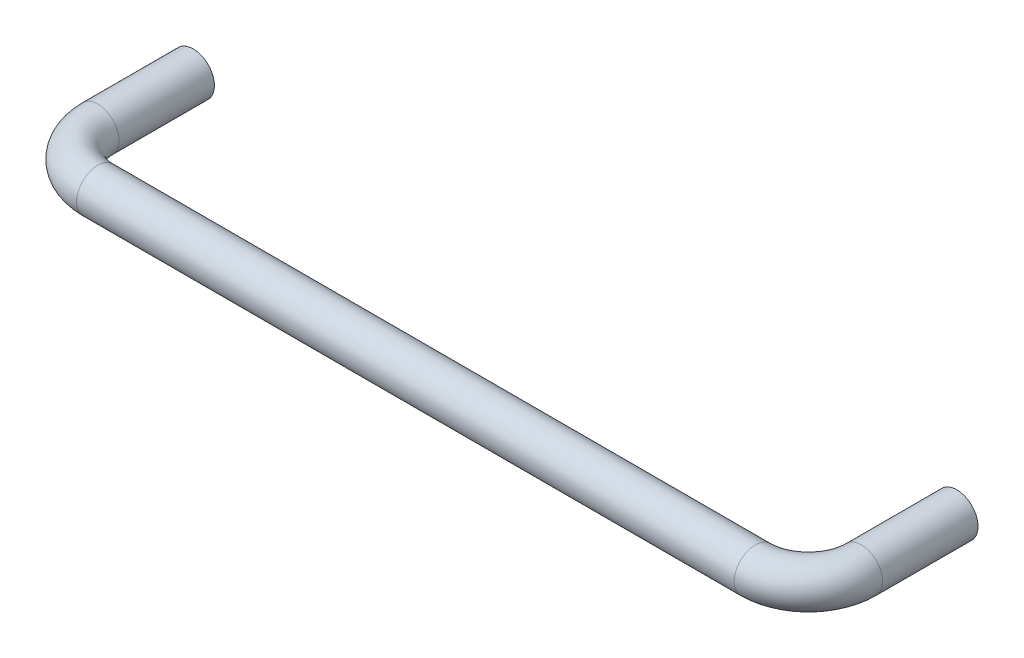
ISO-10303-21;
HEADER;
FILE_DESCRIPTION(('STEP AP214'),'2;1');
FILE_NAME('part.step','',(''),(''),'','','');
FILE_SCHEMA(('AUTOMOTIVE_DESIGN { 1 0 10303 214 1 1 1 1 }'));
ENDSEC;
DATA;
#1=APPLICATION_CONTEXT('core data for automotive mechanical design processes');
#2=APPLICATION_PROTOCOL_DEFINITION('international standard','automotive_design',2000,#1);
#3=PRODUCT_CONTEXT('',#1,'mechanical');
#4=PRODUCT('Part','Part','',(#3));
#5=PRODUCT_RELATED_PRODUCT_CATEGORY('part','',(#4));
#6=PRODUCT_DEFINITION_FORMATION('','',#4);
#7=PRODUCT_DEFINITION_CONTEXT('part definition',#1,'design');
#8=PRODUCT_DEFINITION('design','',#6,#7);
#9=PRODUCT_DEFINITION_SHAPE('','',#8);
#10=(LENGTH_UNIT() NAMED_UNIT(*) SI_UNIT(.MILLI.,.METRE.));
#11=(NAMED_UNIT(*) PLANE_ANGLE_UNIT() SI_UNIT($,.RADIAN.));
#12=(NAMED_UNIT(*) SI_UNIT($,.STERADIAN.) SOLID_ANGLE_UNIT());
#13=UNCERTAINTY_MEASURE_WITH_UNIT(LENGTH_MEASURE(1.E-05),#10,'distance_accuracy_value','');
#14=(GEOMETRIC_REPRESENTATION_CONTEXT(3) GLOBAL_UNCERTAINTY_ASSIGNED_CONTEXT((#13)) GLOBAL_UNIT_ASSIGNED_CONTEXT((#10,
#11,#12)) REPRESENTATION_CONTEXT('',''));
#15=CARTESIAN_POINT('',(0.,0.,0.));
#16=DIRECTION('',(0.,0.,1.));
#17=DIRECTION('',(1.,0.,0.));
#18=AXIS2_PLACEMENT_3D('',#15,#16,#17);
#19=CARTESIAN_POINT('',(0.,0.,22.5));
#20=DIRECTION('',(0.,0.,-1.));
#21=DIRECTION('',(-1.,0.,0.));
#22=AXIS2_PLACEMENT_3D('',#19,#20,#21);
#23=CYLINDRICAL_SURFACE('',#22,5.);
#24=CARTESIAN_POINT('',(0.,0.,0.));
#25=DIRECTION('',(0.,0.,-1.));
#26=DIRECTION('',(-1.,0.,0.));
#27=AXIS2_PLACEMENT_3D('',#24,#25,#26);
#28=CIRCLE('',#27,5.);
#29=CARTESIAN_POINT('',(-5.00000000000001,0.,0.));
#30=VERTEX_POINT('',#29);
#31=EDGE_CURVE('E53',#30,#30,#28,.T.);
#32=ORIENTED_EDGE('',*,*,#31,.F.);
#33=EDGE_LOOP('',(#32));
#34=FACE_BOUND('',#33,.T.);
#35=CARTESIAN_POINT('',(0.,0.,22.5));
#36=DIRECTION('',(0.,0.,1.));
#37=DIRECTION('',(0.,1.,0.));
#38=AXIS2_PLACEMENT_3D('',#35,#36,#37);
#39=CIRCLE('',#38,5.);
#40=CARTESIAN_POINT('',(-5.,0.,22.5));
#41=VERTEX_POINT('',#40);
#42=EDGE_CURVE('E41',#41,#41,#39,.T.);
#43=ORIENTED_EDGE('',*,*,#42,.F.);
#44=EDGE_LOOP('',(#43));
#45=FACE_BOUND('',#44,.T.);
#46=ADVANCED_FACE('F12',(#34,#45),#23,.T.);
#47=CARTESIAN_POINT('',(180.,0.,22.5));
#48=DIRECTION('',(0.,0.,-1.));
#49=DIRECTION('',(-1.,0.,0.));
#50=AXIS2_PLACEMENT_3D('',#47,#48,#49);
#51=CYLINDRICAL_SURFACE('',#50,5.);
#52=CARTESIAN_POINT('',(180.,0.,0.));
#53=DIRECTION('',(0.,0.,-1.));
#54=DIRECTION('',(-1.,0.,0.));
#55=AXIS2_PLACEMENT_3D('',#52,#53,#54);
#56=CIRCLE('',#55,5.);
#57=CARTESIAN_POINT('',(175.,0.,0.));
#58=VERTEX_POINT('',#57);
#59=EDGE_CURVE('E50',#58,#58,#56,.T.);
#60=ORIENTED_EDGE('',*,*,#59,.F.);
#61=EDGE_LOOP('',(#60));
#62=FACE_BOUND('',#61,.T.);
#63=CARTESIAN_POINT('',(180.,0.,22.5));
#64=DIRECTION('',(0.,0.,-1.));
#65=DIRECTION('',(0.,1.,0.));
#66=AXIS2_PLACEMENT_3D('',#63,#64,#65);
#67=CIRCLE('',#66,5.);
#68=CARTESIAN_POINT('',(185.,0.,22.5));
#69=VERTEX_POINT('',#68);
#70=EDGE_CURVE('E32',#69,#69,#67,.T.);
#71=ORIENTED_EDGE('',*,*,#70,.T.);
#72=EDGE_LOOP('',(#71));
#73=FACE_BOUND('',#72,.T.);
#74=ADVANCED_FACE('F61',(#62,#73),#51,.T.);
#75=CARTESIAN_POINT('',(167.5,0.,22.5));
#76=DIRECTION('',(0.,1.,0.));
#77=DIRECTION('',(-1.,0.,0.));
#78=AXIS2_PLACEMENT_3D('',#75,#76,#77);
#79=TOROIDAL_SURFACE('',#78,12.5,5.);
#80=CARTESIAN_POINT('',(167.5,0.,35.));
#81=DIRECTION('',(1.,0.,0.));
#82=DIRECTION('',(0.,1.,0.));
#83=AXIS2_PLACEMENT_3D('',#80,#81,#82);
#84=CIRCLE('',#83,5.);
#85=CARTESIAN_POINT('',(167.5,0.,40.));
#86=VERTEX_POINT('',#85);
#87=EDGE_CURVE('E35',#86,#86,#84,.T.);
#88=CARTESIAN_POINT('',(167.5,0.,22.5));
#89=DIRECTION('',(0.,1.,0.));
#90=DIRECTION('',(-1.,0.,0.));
#91=AXIS2_PLACEMENT_3D('',#88,#89,#90);
#92=CIRCLE('',#91,17.5);
#93=EDGE_CURVE('',#86,#69,#92,.T.);
#94=ORIENTED_EDGE('',*,*,#87,.T.);
#95=ORIENTED_EDGE('',*,*,#70,.F.);
#96=ORIENTED_EDGE('',*,*,#93,.T.);
#97=ORIENTED_EDGE('',*,*,#93,.F.);
#98=EDGE_LOOP('',(#94,#96,#95,#97));
#99=FACE_BOUND('',#98,.T.);
#100=ADVANCED_FACE('F75',(#99),#79,.T.);
#101=CARTESIAN_POINT('',(12.5,0.,35.));
#102=DIRECTION('',(1.,0.,0.));
#103=DIRECTION('',(0.,0.,-1.));
#104=AXIS2_PLACEMENT_3D('',#101,#102,#103);
#105=CYLINDRICAL_SURFACE('',#104,5.);
#106=CARTESIAN_POINT('',(12.5,0.,35.));
#107=DIRECTION('',(1.,0.,0.));
#108=DIRECTION('',(0.,1.,0.));
#109=AXIS2_PLACEMENT_3D('',#106,#107,#108);
#110=CIRCLE('',#109,5.);
#111=CARTESIAN_POINT('',(12.5,0.,40.));
#112=VERTEX_POINT('',#111);
#113=EDGE_CURVE('E38',#112,#112,#110,.T.);
#114=ORIENTED_EDGE('',*,*,#113,.T.);
#115=EDGE_LOOP('',(#114));
#116=FACE_BOUND('',#115,.T.);
#117=ORIENTED_EDGE('',*,*,#87,.F.);
#118=EDGE_LOOP('',(#117));
#119=FACE_BOUND('',#118,.T.);
#120=ADVANCED_FACE('F69',(#116,#119),#105,.T.);
#121=CARTESIAN_POINT('',(12.5,0.,22.5));
#122=DIRECTION('',(0.,1.,0.));
#123=DIRECTION('',(-1.,0.,0.));
#124=AXIS2_PLACEMENT_3D('',#121,#122,#123);
#125=TOROIDAL_SURFACE('',#124,12.5,5.);
#126=CARTESIAN_POINT('',(12.5,0.,22.5));
#127=DIRECTION('',(0.,1.,0.));
#128=DIRECTION('',(-1.,0.,0.));
#129=AXIS2_PLACEMENT_3D('',#126,#127,#128);
#130=CIRCLE('',#129,17.5);
#131=EDGE_CURVE('',#41,#112,#130,.T.);
#132=ORIENTED_EDGE('',*,*,#42,.T.);
#133=ORIENTED_EDGE('',*,*,#113,.F.);
#134=ORIENTED_EDGE('',*,*,#131,.T.);
#135=ORIENTED_EDGE('',*,*,#131,.F.);
#136=EDGE_LOOP('',(#132,#134,#133,#135));
#137=FACE_BOUND('',#136,.T.);
#138=ADVANCED_FACE('F65',(#137),#125,.T.);
#139=CARTESIAN_POINT('',(180.,0.,9.99999999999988));
#140=DIRECTION('',(0.,0.,-1.));
#141=DIRECTION('',(-1.,0.,0.));
#142=AXIS2_PLACEMENT_3D('',#139,#140,#141);
#143=PLANE('',#142);
#144=CARTESIAN_POINT('',(180.,0.,9.99999999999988));
#145=DIRECTION('',(0.,0.,-1.));
#146=DIRECTION('',(-1.,0.,0.));
#147=AXIS2_PLACEMENT_3D('',#144,#145,#146);
#148=CIRCLE('',#147,2.5);
#149=CARTESIAN_POINT('',(177.5,0.,9.99999999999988));
#150=VERTEX_POINT('',#149);
#151=EDGE_CURVE('E47',#150,#150,#148,.T.);
#152=ORIENTED_EDGE('',*,*,#151,.T.);
#153=EDGE_LOOP('',(#152));
#154=FACE_BOUND('',#153,.T.);
#155=ADVANCED_FACE('F68',(#154),#143,.T.);
#156=CARTESIAN_POINT('',(180.,0.,-9.00000000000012));
#157=DIRECTION('',(0.,0.,1.));
#158=DIRECTION('',(1.,0.,0.));
#159=AXIS2_PLACEMENT_3D('',#156,#157,#158);
#160=CYLINDRICAL_SURFACE('',#159,2.5);
#161=CARTESIAN_POINT('',(180.,0.,0.449999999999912));
#162=DIRECTION('',(0.,0.,-1.));
#163=DIRECTION('',(-1.,0.,0.));
#164=AXIS2_PLACEMENT_3D('',#161,#162,#163);
#165=CIRCLE('',#164,2.5);
#166=CARTESIAN_POINT('',(177.5,0.,0.449999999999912));
#167=VERTEX_POINT('',#166);
#168=EDGE_CURVE('E8',#167,#167,#165,.T.);
#169=ORIENTED_EDGE('',*,*,#168,.T.);
#170=EDGE_LOOP('',(#169));
#171=FACE_BOUND('',#170,.T.);
#172=ORIENTED_EDGE('',*,*,#151,.F.);
#173=EDGE_LOOP('',(#172));
#174=FACE_BOUND('',#173,.T.);
#175=ADVANCED_FACE('F121',(#171,#174),#160,.F.);
#176=CARTESIAN_POINT('',(204.243306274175,-19.311013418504,0.));
#177=DIRECTION('',(0.,0.,-1.));
#178=DIRECTION('',(-1.,0.,0.));
#179=AXIS2_PLACEMENT_3D('',#176,#177,#178);
#180=PLANE('',#179);
#181=CARTESIAN_POINT('',(180.,0.,0.));
#182=DIRECTION('',(0.,0.,-1.));
#183=DIRECTION('',(-1.,0.,0.));
#184=AXIS2_PLACEMENT_3D('',#181,#182,#183);
#185=CIRCLE('',#184,2.95);
#186=CARTESIAN_POINT('',(177.05,0.,0.));
#187=VERTEX_POINT('',#186);
#188=EDGE_CURVE('E19',#187,#187,#185,.F.);
#189=ORIENTED_EDGE('',*,*,#188,.T.);
#190=EDGE_LOOP('',(#189));
#191=FACE_BOUND('',#190,.T.);
#192=ORIENTED_EDGE('',*,*,#59,.T.);
#193=EDGE_LOOP('',(#192));
#194=FACE_BOUND('',#193,.T.);
#195=ADVANCED_FACE('F104',(#191,#194),#180,.T.);
#196=CARTESIAN_POINT('',(0.,0.,10.));
#197=DIRECTION('',(0.,0.,-1.));
#198=DIRECTION('',(-1.,0.,0.));
#199=AXIS2_PLACEMENT_3D('',#196,#197,#198);
#200=PLANE('',#199);
#201=CARTESIAN_POINT('',(0.,0.,10.));
#202=DIRECTION('',(0.,0.,-1.));
#203=DIRECTION('',(-1.,0.,0.));
#204=AXIS2_PLACEMENT_3D('',#201,#202,#203);
#205=CIRCLE('',#204,2.5);
#206=CARTESIAN_POINT('',(-2.5,0.,10.));
#207=VERTEX_POINT('',#206);
#208=EDGE_CURVE('E44',#207,#207,#205,.T.);
#209=ORIENTED_EDGE('',*,*,#208,.T.);
#210=EDGE_LOOP('',(#209));
#211=FACE_BOUND('',#210,.T.);
#212=ADVANCED_FACE('F111',(#211),#200,.T.);
#213=CARTESIAN_POINT('',(0.,0.,-9.));
#214=DIRECTION('',(0.,0.,1.));
#215=DIRECTION('',(1.,0.,0.));
#216=AXIS2_PLACEMENT_3D('',#213,#214,#215);
#217=CYLINDRICAL_SURFACE('',#216,2.5);
#218=CARTESIAN_POINT('',(0.,0.,0.449999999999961));
#219=DIRECTION('',(0.,0.,-1.));
#220=DIRECTION('',(-1.,0.,0.));
#221=AXIS2_PLACEMENT_3D('',#218,#219,#220);
#222=CIRCLE('',#221,2.5);
#223=CARTESIAN_POINT('',(-2.5,0.,0.449999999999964));
#224=VERTEX_POINT('',#223);
#225=EDGE_CURVE('E27',#224,#224,#222,.T.);
#226=ORIENTED_EDGE('',*,*,#225,.T.);
#227=EDGE_LOOP('',(#226));
#228=FACE_BOUND('',#227,.T.);
#229=ORIENTED_EDGE('',*,*,#208,.F.);
#230=EDGE_LOOP('',(#229));
#231=FACE_BOUND('',#230,.T.);
#232=ADVANCED_FACE('F101',(#228,#231),#217,.F.);
#233=CARTESIAN_POINT('',(0.,0.,0.));
#234=DIRECTION('',(0.,0.,-1.));
#235=DIRECTION('',(-1.,0.,0.));
#236=AXIS2_PLACEMENT_3D('',#233,#234,#235);
#237=CIRCLE('',#236,2.94999999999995);
#238=CARTESIAN_POINT('',(-2.94999999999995,0.,0.));
#239=VERTEX_POINT('',#238);
#240=EDGE_CURVE('E23',#239,#239,#237,.F.);
#241=ORIENTED_EDGE('',*,*,#240,.T.);
#242=EDGE_LOOP('',(#241));
#243=FACE_BOUND('',#242,.T.);
#244=ORIENTED_EDGE('',*,*,#31,.T.);
#245=EDGE_LOOP('',(#244));
#246=FACE_BOUND('',#245,.T.);
#247=ADVANCED_FACE('F57',(#243,#246),#180,.T.);
#248=CARTESIAN_POINT('',(0.,0.,0.449999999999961));
#249=DIRECTION('',(0.,0.,-1.));
#250=DIRECTION('',(-1.,0.,0.));
#251=AXIS2_PLACEMENT_3D('',#248,#249,#250);
#252=CONICAL_SURFACE('',#251,2.5,0.785398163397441);
#253=ORIENTED_EDGE('',*,*,#240,.F.);
#254=EDGE_LOOP('',(#253));
#255=FACE_BOUND('',#254,.T.);
#256=ORIENTED_EDGE('',*,*,#225,.F.);
#257=EDGE_LOOP('',(#256));
#258=FACE_BOUND('',#257,.T.);
#259=ADVANCED_FACE('F92',(#255,#258),#252,.F.);
#260=CARTESIAN_POINT('',(180.,0.,0.));
#261=DIRECTION('',(0.,0.,-1.));
#262=DIRECTION('',(-1.,0.,0.));
#263=AXIS2_PLACEMENT_3D('',#260,#261,#262);
#264=CONICAL_SURFACE('',#263,2.95,0.785398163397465);
#265=ORIENTED_EDGE('',*,*,#168,.F.);
#266=EDGE_LOOP('',(#265));
#267=FACE_BOUND('',#266,.T.);
#268=ORIENTED_EDGE('',*,*,#188,.F.);
#269=EDGE_LOOP('',(#268));
#270=FACE_BOUND('',#269,.T.);
#271=ADVANCED_FACE('F14',(#267,#270),#264,.F.);
#272=CLOSED_SHELL('',(#46,#74,#100,#120,#138,#155,#175,#195,#212,#232,#247,#259,#271));
#273=MANIFOLD_SOLID_BREP('B1',#272);
#274=ADVANCED_BREP_SHAPE_REPRESENTATION('',(#18,#273),#14);
#275=SHAPE_DEFINITION_REPRESENTATION(#9,#274);
ENDSEC;
END-ISO-10303-21;
